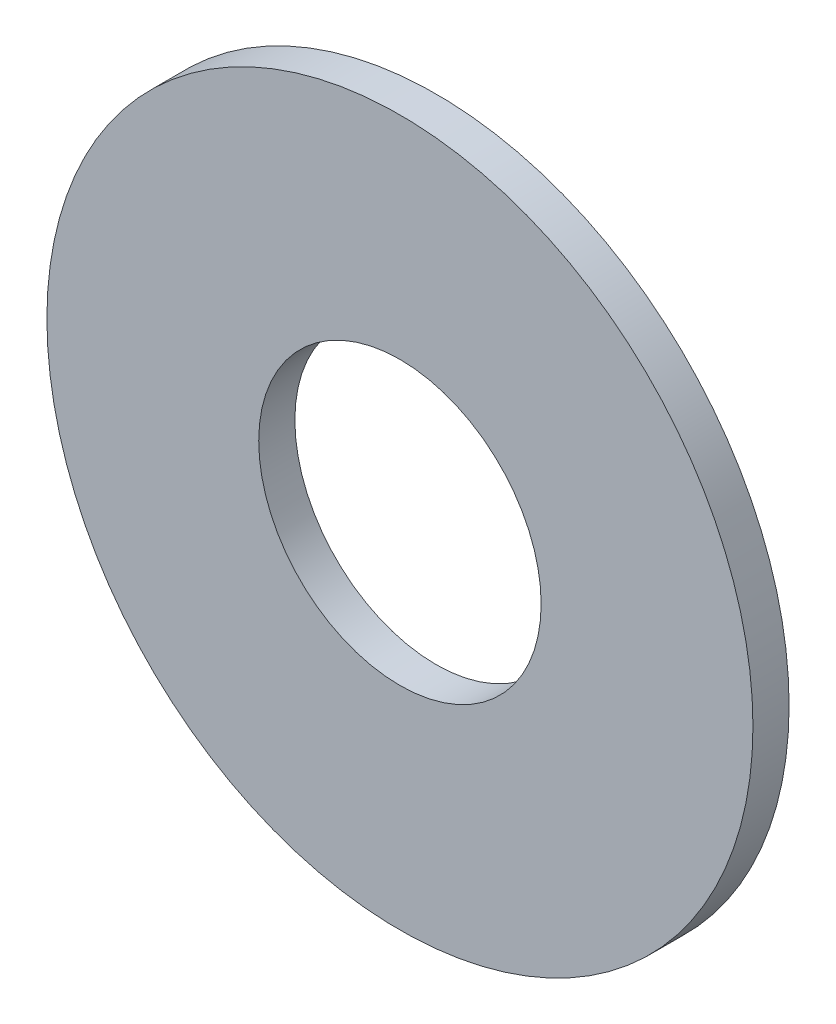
ISO-10303-21;
HEADER;
FILE_DESCRIPTION(('STEP AP214'),'2;1');
FILE_NAME('part.step','',(''),(''),'','','');
FILE_SCHEMA(('AUTOMOTIVE_DESIGN { 1 0 10303 214 1 1 1 1 }'));
ENDSEC;
DATA;
#1=APPLICATION_CONTEXT('core data for automotive mechanical design processes');
#2=APPLICATION_PROTOCOL_DEFINITION('international standard','automotive_design',2000,#1);
#3=PRODUCT_CONTEXT('',#1,'mechanical');
#4=PRODUCT('Part','Part','',(#3));
#5=PRODUCT_RELATED_PRODUCT_CATEGORY('part','',(#4));
#6=PRODUCT_DEFINITION_FORMATION('','',#4);
#7=PRODUCT_DEFINITION_CONTEXT('part definition',#1,'design');
#8=PRODUCT_DEFINITION('design','',#6,#7);
#9=PRODUCT_DEFINITION_SHAPE('','',#8);
#10=(LENGTH_UNIT() NAMED_UNIT(*) SI_UNIT(.MILLI.,.METRE.));
#11=(NAMED_UNIT(*) PLANE_ANGLE_UNIT() SI_UNIT($,.RADIAN.));
#12=(NAMED_UNIT(*) SI_UNIT($,.STERADIAN.) SOLID_ANGLE_UNIT());
#13=UNCERTAINTY_MEASURE_WITH_UNIT(LENGTH_MEASURE(1.E-05),#10,'distance_accuracy_value','');
#14=(GEOMETRIC_REPRESENTATION_CONTEXT(3) GLOBAL_UNCERTAINTY_ASSIGNED_CONTEXT((#13)) GLOBAL_UNIT_ASSIGNED_CONTEXT((#10,
#11,#12)) REPRESENTATION_CONTEXT('',''));
#15=CARTESIAN_POINT('',(0.,0.,0.));
#16=DIRECTION('',(0.,0.,1.));
#17=DIRECTION('',(1.,0.,0.));
#18=AXIS2_PLACEMENT_3D('',#15,#16,#17);
#19=CARTESIAN_POINT('',(0.,0.,0.8128));
#20=DIRECTION('',(0.,0.,1.));
#21=DIRECTION('',(1.,0.,0.));
#22=AXIS2_PLACEMENT_3D('',#19,#20,#21);
#23=PLANE('',#22);
#24=CARTESIAN_POINT('',(0.,0.,0.8128));
#25=DIRECTION('',(0.,0.,1.));
#26=DIRECTION('',(1.,0.,0.));
#27=AXIS2_PLACEMENT_3D('',#24,#25,#26);
#28=CIRCLE('',#27,7.9375);
#29=CARTESIAN_POINT('',(7.9375,0.,0.8128));
#30=VERTEX_POINT('',#29);
#31=EDGE_CURVE('E10',#30,#30,#28,.T.);
#32=ORIENTED_EDGE('',*,*,#31,.T.);
#33=EDGE_LOOP('',(#32));
#34=FACE_BOUND('',#33,.T.);
#35=CARTESIAN_POINT('',(0.,0.,0.8128));
#36=DIRECTION('',(0.,0.,1.));
#37=DIRECTION('',(1.,0.,0.));
#38=AXIS2_PLACEMENT_3D('',#35,#36,#37);
#39=CIRCLE('',#38,3.175);
#40=CARTESIAN_POINT('',(3.175,0.,0.8128));
#41=VERTEX_POINT('',#40);
#42=EDGE_CURVE('E41',#41,#41,#39,.T.);
#43=ORIENTED_EDGE('',*,*,#42,.F.);
#44=EDGE_LOOP('',(#43));
#45=FACE_BOUND('',#44,.T.);
#46=ADVANCED_FACE('F30',(#34,#45),#23,.T.);
#47=CARTESIAN_POINT('',(0.,0.,0.));
#48=DIRECTION('',(0.,0.,1.));
#49=DIRECTION('',(1.,0.,0.));
#50=AXIS2_PLACEMENT_3D('',#47,#48,#49);
#51=PLANE('',#50);
#52=CARTESIAN_POINT('',(0.,0.,0.));
#53=DIRECTION('',(0.,0.,1.));
#54=DIRECTION('',(1.,0.,0.));
#55=AXIS2_PLACEMENT_3D('',#52,#53,#54);
#56=CIRCLE('',#55,7.9375);
#57=CARTESIAN_POINT('',(7.9375,0.,0.));
#58=VERTEX_POINT('',#57);
#59=EDGE_CURVE('E34',#58,#58,#56,.T.);
#60=ORIENTED_EDGE('',*,*,#59,.F.);
#61=EDGE_LOOP('',(#60));
#62=FACE_BOUND('',#61,.T.);
#63=CARTESIAN_POINT('',(0.,0.,0.));
#64=DIRECTION('',(0.,0.,1.));
#65=DIRECTION('',(1.,0.,0.));
#66=AXIS2_PLACEMENT_3D('',#63,#64,#65);
#67=CIRCLE('',#66,3.175);
#68=CARTESIAN_POINT('',(3.175,0.,0.));
#69=VERTEX_POINT('',#68);
#70=EDGE_CURVE('E43',#69,#69,#67,.T.);
#71=ORIENTED_EDGE('',*,*,#70,.T.);
#72=EDGE_LOOP('',(#71));
#73=FACE_BOUND('',#72,.T.);
#74=ADVANCED_FACE('F53',(#62,#73),#51,.F.);
#75=CARTESIAN_POINT('',(0.,0.,0.8128));
#76=DIRECTION('',(0.,0.,-1.));
#77=DIRECTION('',(-1.,0.,0.));
#78=AXIS2_PLACEMENT_3D('',#75,#76,#77);
#79=CYLINDRICAL_SURFACE('',#78,7.9375);
#80=ORIENTED_EDGE('',*,*,#31,.F.);
#81=EDGE_LOOP('',(#80));
#82=FACE_BOUND('',#81,.T.);
#83=ORIENTED_EDGE('',*,*,#59,.T.);
#84=EDGE_LOOP('',(#83));
#85=FACE_BOUND('',#84,.T.);
#86=ADVANCED_FACE('F32',(#82,#85),#79,.T.);
#87=CARTESIAN_POINT('',(0.,0.,0.8128));
#88=DIRECTION('',(0.,0.,-1.));
#89=DIRECTION('',(-1.,0.,0.));
#90=AXIS2_PLACEMENT_3D('',#87,#88,#89);
#91=CYLINDRICAL_SURFACE('',#90,3.175);
#92=ORIENTED_EDGE('',*,*,#42,.T.);
#93=EDGE_LOOP('',(#92));
#94=FACE_BOUND('',#93,.T.);
#95=ORIENTED_EDGE('',*,*,#70,.F.);
#96=EDGE_LOOP('',(#95));
#97=FACE_BOUND('',#96,.T.);
#98=ADVANCED_FACE('F49',(#94,#97),#91,.F.);
#99=CLOSED_SHELL('',(#46,#74,#86,#98));
#100=MANIFOLD_SOLID_BREP('B2',#99);
#101=ADVANCED_BREP_SHAPE_REPRESENTATION('',(#18,#100),#14);
#102=SHAPE_DEFINITION_REPRESENTATION(#9,#101);
ENDSEC;
END-ISO-10303-21;
